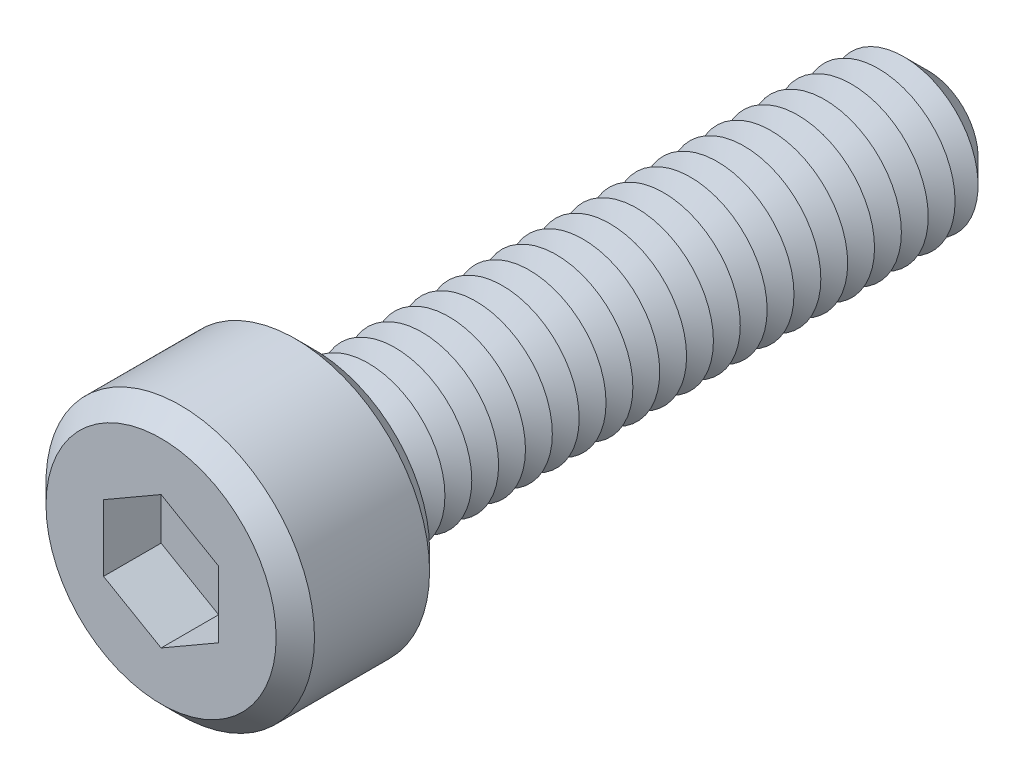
from build123d import *

# Parameters (mm, degrees)
SKETCH1_R           = 3.5
BOSS_EXTRUDE1_DEPTH = 4
SKETCH2_R           = 2
BOSS_EXTRUDE2_DEPTH = 16
CHAMFER1_SIZE       = 0.7
LPATTERN1_COUNT     = 22
LPATTERN1_PITCH     = 0.7
CUT_EXTRUDE1_DEPTH  = 1.5
SKETCH6_R           = 0.5
CUT_EXTRUDE2_DEPTH  = 18.5
CHAMFER2_SIZE       = 0.5


with BuildPart() as part:
    # Sketch1 → Boss-Extrude1 (new body)
    with BuildSketch(Plane.XY):
        Circle(SKETCH1_R)
    extrude(amount=BOSS_EXTRUDE1_DEPTH)

    # Sketch2 → Boss-Extrude2 (add)
    with BuildSketch(Plane(origin=(0, 0, 0), x_dir=(-1, 0, 0), z_dir=(0, 0, -1))):
        Circle(SKETCH2_R)
    extrude(amount=BOSS_EXTRUDE2_DEPTH)

    # Chamfer1
    chamfer1_edges = [part.edges().sort_by_distance(p)[0] for p in [
        (2, 0, -16),
    ]]
    chamfer(chamfer1_edges, length=CHAMFER1_SIZE)

    # Sketch4 → Cut-Revolve1 (revolve, cut)
    with BuildSketch(Plane(origin=(0, 0, 0), x_dir=(0, 0, -1), z_dir=(1, 0, 0)), mode=Mode.PRIVATE) as cut_revolve1_sk:
        Polygon((0, 2), (0.35, 1.393782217), (0.7, 2), align=None)
    cut_revolve1 = revolve(cut_revolve1_sk.sketch.rotate(Axis((0, 0, 2.512122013), (0, 0, -1)), 90), axis=Axis((0, 0, 2.512122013), (0, 0, -1)), mode=Mode.SUBTRACT)

    # LPattern1: Cut-Revolve1 ×22
    with Locations(*[(0, 0, -i * LPATTERN1_PITCH) for i in range(1, LPATTERN1_COUNT)]):
        add(cut_revolve1, mode=Mode.SUBTRACT)

    # Sketch5 → Cut-Extrude1 (cut)
    with BuildSketch(Plane.XY.offset(4)):
        Polygon((0, 1.732050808), (-1.5, 0.866025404), (-1.5, -0.866025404), (0, -1.732050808), (1.5, -0.866025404), (1.5, 0.866025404), align=None)
    extrude(amount=-CUT_EXTRUDE1_DEPTH, mode=Mode.SUBTRACT)

    # Sketch6 → Cut-Extrude2 (cut)
    with BuildSketch(Plane.XY.offset(2.5)):
        Circle(SKETCH6_R)
    extrude(amount=-CUT_EXTRUDE2_DEPTH, mode=Mode.SUBTRACT)

    # Chamfer2
    chamfer2_edges = [part.edges().sort_by_distance(p)[0] for p in [
        (-3.5, 0, 0),
        (-3.5, 0, 4),
    ]]
    chamfer(chamfer2_edges, length=CHAMFER2_SIZE)


solid = part.part
